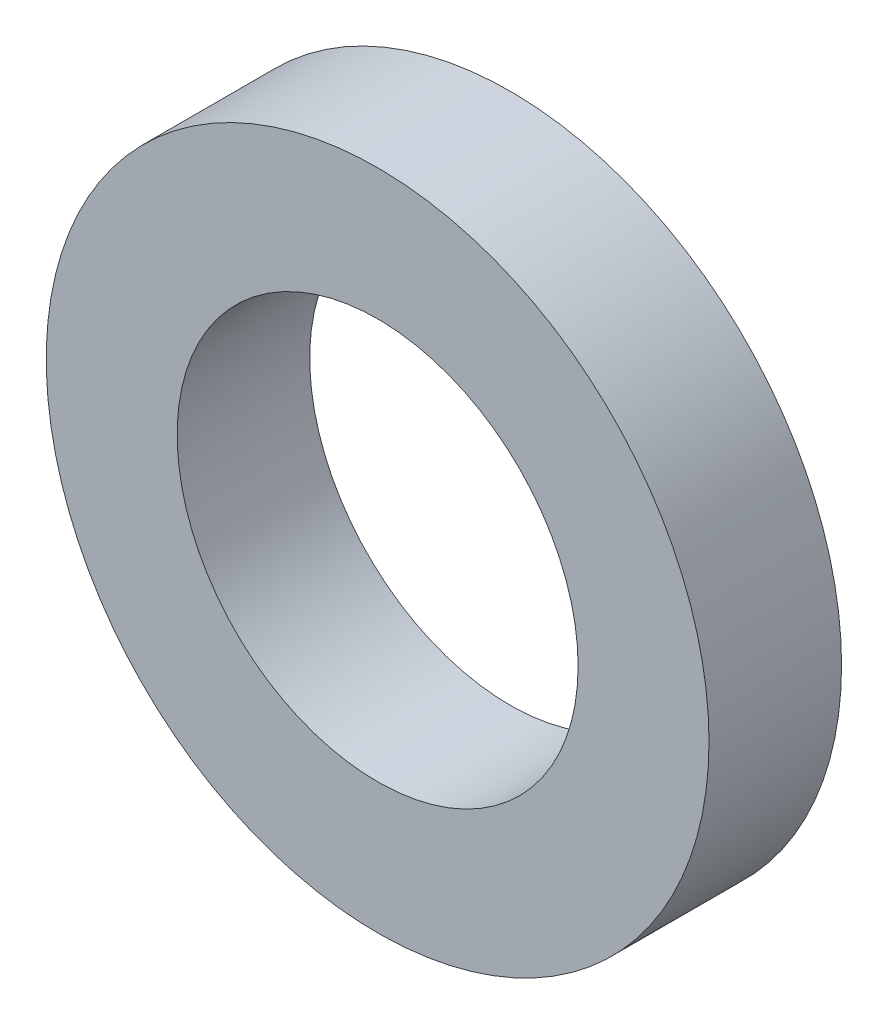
from build123d import *

# Parameters (mm, degrees)
ESQUISSE1_R      = 10
ESQUISSE1_R_2    = 6.05
EXTRUSION1_DEPTH = 4


with BuildPart() as part:
    # Esquisse1 → Extrusion1 (new body)
    with BuildSketch(Plane.XY):
        Circle(ESQUISSE1_R)
        Circle(ESQUISSE1_R_2, mode=Mode.SUBTRACT)
    extrude(amount=EXTRUSION1_DEPTH)


solid = part.part
